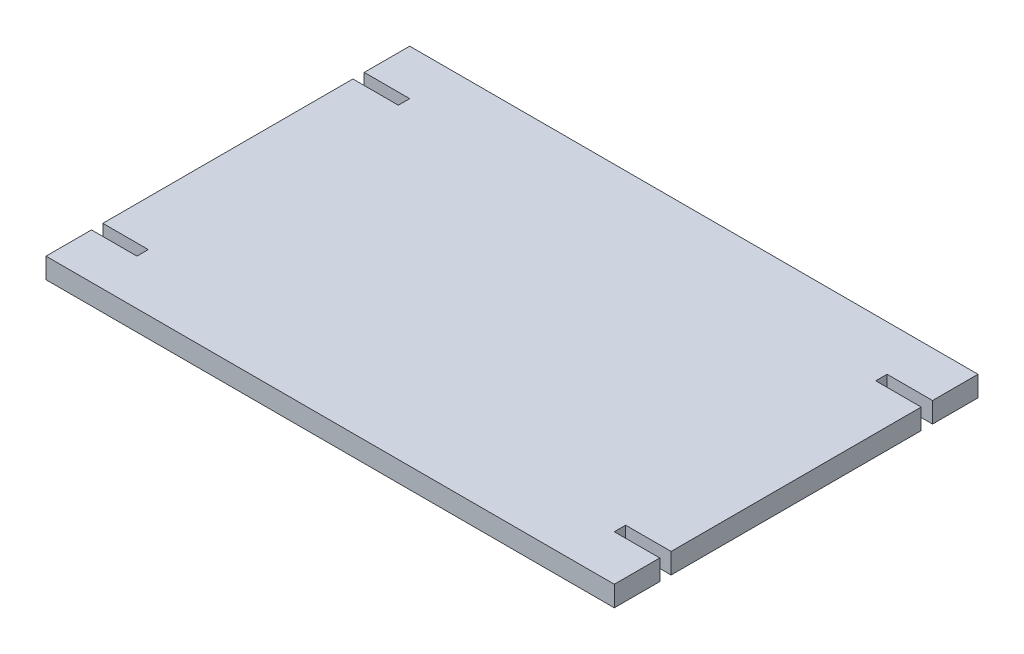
from build123d import *

# Parameters (mm, degrees)
BOSS_EXTRUDE1_DEPTH = 18


with BuildPart() as part:
    # Sketch1 → Boss-Extrude1 (new body)
    with BuildSketch(Plane(origin=(0, 0, 0), x_dir=(1, 0, 0), z_dir=(0, 1, 0))):
        Polygon((-301.875, 208.229166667), (198.125, 208.229166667), (198.125, 168.229166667), (158.125, 168.229166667), (158.125, 158.229166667), (198.125, 158.229166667), (198.125, -61.770833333), (158.125, -61.770833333), (158.125, -71.770833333), (198.125, -71.770833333), (198.125, -111.770833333), (-301.875, -111.770833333), (-301.875, -71.770833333), (-261.875, -71.770833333), (-261.875, -61.770833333), (-301.875, -61.770833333), (-301.875, 158.229166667), (-261.875, 158.229166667), (-261.875, 168.229166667), (-301.875, 168.229166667), align=None)
    extrude(amount=BOSS_EXTRUDE1_DEPTH)


solid = part.part
